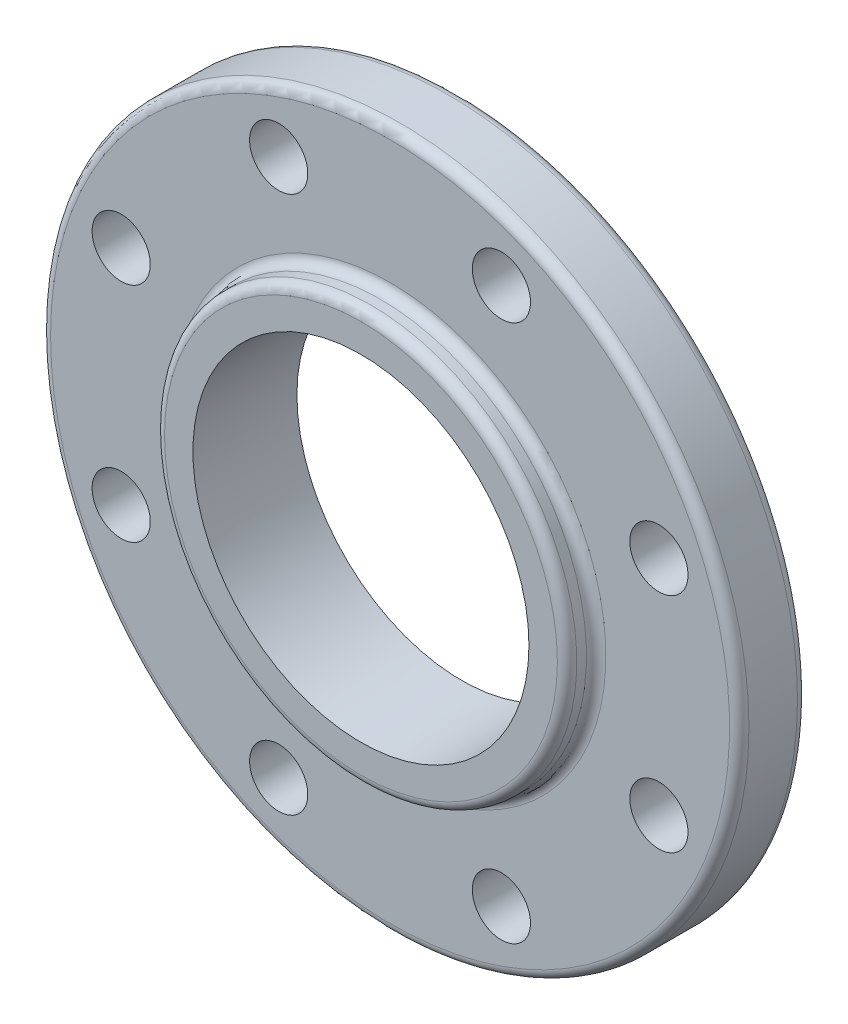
ISO-10303-21;
HEADER;
FILE_DESCRIPTION(('STEP AP214'),'2;1');
FILE_NAME('part.step','',(''),(''),'','','');
FILE_SCHEMA(('AUTOMOTIVE_DESIGN { 1 0 10303 214 1 1 1 1 }'));
ENDSEC;
DATA;
#1=APPLICATION_CONTEXT('core data for automotive mechanical design processes');
#2=APPLICATION_PROTOCOL_DEFINITION('international standard','automotive_design',2000,#1);
#3=PRODUCT_CONTEXT('',#1,'mechanical');
#4=PRODUCT('Part','Part','',(#3));
#5=PRODUCT_RELATED_PRODUCT_CATEGORY('part','',(#4));
#6=PRODUCT_DEFINITION_FORMATION('','',#4);
#7=PRODUCT_DEFINITION_CONTEXT('part definition',#1,'design');
#8=PRODUCT_DEFINITION('design','',#6,#7);
#9=PRODUCT_DEFINITION_SHAPE('','',#8);
#10=(LENGTH_UNIT() NAMED_UNIT(*) SI_UNIT(.MILLI.,.METRE.));
#11=(NAMED_UNIT(*) PLANE_ANGLE_UNIT() SI_UNIT($,.RADIAN.));
#12=(NAMED_UNIT(*) SI_UNIT($,.STERADIAN.) SOLID_ANGLE_UNIT());
#13=UNCERTAINTY_MEASURE_WITH_UNIT(LENGTH_MEASURE(1.E-05),#10,'distance_accuracy_value','');
#14=(GEOMETRIC_REPRESENTATION_CONTEXT(3) GLOBAL_UNCERTAINTY_ASSIGNED_CONTEXT((#13)) GLOBAL_UNIT_ASSIGNED_CONTEXT((#10,
#11,#12)) REPRESENTATION_CONTEXT('',''));
#15=CARTESIAN_POINT('',(0.,0.,0.));
#16=DIRECTION('',(0.,0.,1.));
#17=DIRECTION('',(1.,0.,0.));
#18=AXIS2_PLACEMENT_3D('',#15,#16,#17);
#19=CARTESIAN_POINT('',(0.,0.,33.3375));
#20=DIRECTION('',(0.,0.,-1.));
#21=DIRECTION('',(-1.00000000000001,0.,0.));
#22=AXIS2_PLACEMENT_3D('',#19,#20,#21);
#23=PLANE('',#22);
#24=CARTESIAN_POINT('',(0.,0.,33.3375));
#25=DIRECTION('',(0.,0.,-1.));
#26=DIRECTION('',(-1.00000000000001,0.,0.));
#27=AXIS2_PLACEMENT_3D('',#24,#25,#26);
#28=CIRCLE('',#27,64.29375);
#29=CARTESIAN_POINT('',(-64.2937500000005,0.,33.3375));
#30=VERTEX_POINT('',#29);
#31=EDGE_CURVE('E10',#30,#30,#28,.T.);
#32=ORIENTED_EDGE('',*,*,#31,.F.);
#33=EDGE_LOOP('',(#32));
#34=FACE_BOUND('',#33,.T.);
#35=CARTESIAN_POINT('',(0.,0.,33.3375));
#36=DIRECTION('',(0.,0.,1.));
#37=DIRECTION('',(1.00000000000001,0.,0.));
#38=AXIS2_PLACEMENT_3D('',#35,#36,#37);
#39=CIRCLE('',#38,54.991);
#40=CARTESIAN_POINT('',(54.9910000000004,0.,33.3375));
#41=VERTEX_POINT('',#40);
#42=EDGE_CURVE('E127',#41,#41,#39,.T.);
#43=ORIENTED_EDGE('',*,*,#42,.F.);
#44=EDGE_LOOP('',(#43));
#45=FACE_BOUND('',#44,.T.);
#46=ADVANCED_FACE('F30',(#34,#45),#23,.F.);
#47=CARTESIAN_POINT('',(0.,0.,30.1625));
#48=DIRECTION('',(0.,0.,-1.));
#49=DIRECTION('',(-1.00000000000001,0.,0.));
#50=AXIS2_PLACEMENT_3D('',#47,#48,#49);
#51=TOROIDAL_SURFACE('',#50,64.29375,3.175);
#52=CARTESIAN_POINT('',(0.,0.,30.1625));
#53=DIRECTION('',(0.,0.,-1.));
#54=DIRECTION('',(-1.00000000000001,0.,0.));
#55=AXIS2_PLACEMENT_3D('',#52,#53,#54);
#56=CIRCLE('',#55,67.46875);
#57=CARTESIAN_POINT('',(-67.4687500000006,0.,30.1625));
#58=VERTEX_POINT('',#57);
#59=EDGE_CURVE('E36',#58,#58,#56,.T.);
#60=ORIENTED_EDGE('',*,*,#59,.F.);
#61=EDGE_LOOP('',(#60));
#62=FACE_BOUND('',#61,.T.);
#63=ORIENTED_EDGE('',*,*,#31,.T.);
#64=EDGE_LOOP('',(#63));
#65=FACE_BOUND('',#64,.T.);
#66=ADVANCED_FACE('F134',(#62,#65),#51,.T.);
#67=CARTESIAN_POINT('',(0.,0.,-31.2122387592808));
#68=DIRECTION('',(0.,0.,-1.));
#69=DIRECTION('',(-1.00000000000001,0.,0.));
#70=AXIS2_PLACEMENT_3D('',#67,#68,#69);
#71=CYLINDRICAL_SURFACE('',#70,67.46875);
#72=CARTESIAN_POINT('',(0.,0.,26.9875));
#73=DIRECTION('',(0.,0.,-1.));
#74=DIRECTION('',(-1.00000000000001,0.,0.));
#75=AXIS2_PLACEMENT_3D('',#72,#73,#74);
#76=CIRCLE('',#75,67.46875);
#77=CARTESIAN_POINT('',(-67.4687500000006,0.,26.9875));
#78=VERTEX_POINT('',#77);
#79=EDGE_CURVE('E40',#78,#78,#76,.T.);
#80=ORIENTED_EDGE('',*,*,#79,.F.);
#81=EDGE_LOOP('',(#80));
#82=FACE_BOUND('',#81,.T.);
#83=ORIENTED_EDGE('',*,*,#59,.T.);
#84=EDGE_LOOP('',(#83));
#85=FACE_BOUND('',#84,.T.);
#86=ADVANCED_FACE('F139',(#82,#85),#71,.T.);
#87=CARTESIAN_POINT('',(0.,0.,26.9875));
#88=DIRECTION('',(0.,0.,-1.));
#89=DIRECTION('',(-1.00000000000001,0.,0.));
#90=AXIS2_PLACEMENT_3D('',#87,#88,#89);
#91=TOROIDAL_SURFACE('',#90,70.64375,3.17500000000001);
#92=CARTESIAN_POINT('',(0.,0.,23.8125));
#93=DIRECTION('',(0.,0.,-1.));
#94=DIRECTION('',(-1.00000000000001,0.,0.));
#95=AXIS2_PLACEMENT_3D('',#92,#93,#94);
#96=CIRCLE('',#95,70.64375);
#97=CARTESIAN_POINT('',(-70.6437500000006,0.,23.8125));
#98=VERTEX_POINT('',#97);
#99=EDGE_CURVE('E44',#98,#98,#96,.T.);
#100=ORIENTED_EDGE('',*,*,#99,.F.);
#101=EDGE_LOOP('',(#100));
#102=FACE_BOUND('',#101,.T.);
#103=ORIENTED_EDGE('',*,*,#79,.T.);
#104=EDGE_LOOP('',(#103));
#105=FACE_BOUND('',#104,.T.);
#106=ADVANCED_FACE('F144',(#102,#105),#91,.F.);
#107=CARTESIAN_POINT('',(111.125,0.,23.8125));
#108=DIRECTION('',(0.,0.,-1.));
#109=DIRECTION('',(-1.00000000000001,0.,0.));
#110=AXIS2_PLACEMENT_3D('',#107,#108,#109);
#111=PLANE('',#110);
#112=CARTESIAN_POINT('',(36.4505969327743,87.9995254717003,23.8125));
#113=DIRECTION('',(0.,0.,-1.));
#114=DIRECTION('',(-1.00000000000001,0.,0.));
#115=AXIS2_PLACEMENT_3D('',#112,#113,#114);
#116=CIRCLE('',#115,9.525);
#117=CARTESIAN_POINT('',(26.9255969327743,87.9995254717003,23.8125));
#118=VERTEX_POINT('',#117);
#119=EDGE_CURVE('E112',#118,#118,#116,.T.);
#120=ORIENTED_EDGE('',*,*,#119,.T.);
#121=EDGE_LOOP('',(#120));
#122=FACE_BOUND('',#121,.T.);
#123=CARTESIAN_POINT('',(87.9995254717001,36.4505969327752,23.8125));
#124=DIRECTION('',(0.,0.,-1.));
#125=DIRECTION('',(-1.00000000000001,0.,0.));
#126=AXIS2_PLACEMENT_3D('',#123,#124,#125);
#127=CIRCLE('',#126,9.525);
#128=CARTESIAN_POINT('',(78.4745254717,36.4505969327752,23.8125));
#129=VERTEX_POINT('',#128);
#130=EDGE_CURVE('E106',#129,#129,#127,.T.);
#131=ORIENTED_EDGE('',*,*,#130,.T.);
#132=EDGE_LOOP('',(#131));
#133=FACE_BOUND('',#132,.T.);
#134=CARTESIAN_POINT('',(87.9995254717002,-36.4505969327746,23.8125));
#135=DIRECTION('',(0.,0.,-1.));
#136=DIRECTION('',(-1.00000000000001,0.,0.));
#137=AXIS2_PLACEMENT_3D('',#134,#135,#136);
#138=CIRCLE('',#137,9.525);
#139=CARTESIAN_POINT('',(78.4745254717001,-36.4505969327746,23.8125));
#140=VERTEX_POINT('',#139);
#141=EDGE_CURVE('E100',#140,#140,#138,.T.);
#142=ORIENTED_EDGE('',*,*,#141,.T.);
#143=EDGE_LOOP('',(#142));
#144=FACE_BOUND('',#143,.T.);
#145=CARTESIAN_POINT('',(36.4505969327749,-87.9995254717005,23.8125));
#146=DIRECTION('',(0.,0.,-1.));
#147=DIRECTION('',(-1.00000000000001,0.,0.));
#148=AXIS2_PLACEMENT_3D('',#145,#146,#147);
#149=CIRCLE('',#148,9.525);
#150=CARTESIAN_POINT('',(26.9255969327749,-87.9995254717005,23.8125));
#151=VERTEX_POINT('',#150);
#152=EDGE_CURVE('E94',#151,#151,#149,.T.);
#153=ORIENTED_EDGE('',*,*,#152,.T.);
#154=EDGE_LOOP('',(#153));
#155=FACE_BOUND('',#154,.T.);
#156=CARTESIAN_POINT('',(-36.4505969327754,-87.9995254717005,23.8125));
#157=DIRECTION('',(0.,0.,-1.));
#158=DIRECTION('',(-1.00000000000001,0.,0.));
#159=AXIS2_PLACEMENT_3D('',#156,#157,#158);
#160=CIRCLE('',#159,9.525);
#161=CARTESIAN_POINT('',(-45.9755969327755,-87.9995254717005,23.8125));
#162=VERTEX_POINT('',#161);
#163=EDGE_CURVE('E88',#162,#162,#160,.T.);
#164=ORIENTED_EDGE('',*,*,#163,.T.);
#165=EDGE_LOOP('',(#164));
#166=FACE_BOUND('',#165,.T.);
#167=CARTESIAN_POINT('',(-87.999525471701,-36.4505969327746,23.8125));
#168=DIRECTION('',(0.,0.,-1.));
#169=DIRECTION('',(-1.00000000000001,0.,0.));
#170=AXIS2_PLACEMENT_3D('',#167,#168,#169);
#171=CIRCLE('',#170,9.525);
#172=CARTESIAN_POINT('',(-97.5245254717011,-36.4505969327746,23.8125));
#173=VERTEX_POINT('',#172);
#174=EDGE_CURVE('E82',#173,#173,#171,.T.);
#175=ORIENTED_EDGE('',*,*,#174,.T.);
#176=EDGE_LOOP('',(#175));
#177=FACE_BOUND('',#176,.T.);
#178=CARTESIAN_POINT('',(-87.9995254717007,36.4505969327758,23.8125));
#179=DIRECTION('',(0.,0.,-1.));
#180=DIRECTION('',(-1.00000000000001,0.,0.));
#181=AXIS2_PLACEMENT_3D('',#178,#179,#180);
#182=CIRCLE('',#181,9.525);
#183=CARTESIAN_POINT('',(-97.5245254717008,36.4505969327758,23.8125));
#184=VERTEX_POINT('',#183);
#185=EDGE_CURVE('E76',#184,#184,#182,.T.);
#186=ORIENTED_EDGE('',*,*,#185,.T.);
#187=EDGE_LOOP('',(#186));
#188=FACE_BOUND('',#187,.T.);
#189=CARTESIAN_POINT('',(-36.4505969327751,87.9995254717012,23.8125));
#190=DIRECTION('',(0.,0.,-1.));
#191=DIRECTION('',(-1.00000000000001,0.,0.));
#192=AXIS2_PLACEMENT_3D('',#189,#190,#191);
#193=CIRCLE('',#192,9.525);
#194=CARTESIAN_POINT('',(-45.9755969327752,87.9995254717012,23.8125));
#195=VERTEX_POINT('',#194);
#196=EDGE_CURVE('E70',#195,#195,#193,.T.);
#197=ORIENTED_EDGE('',*,*,#196,.T.);
#198=EDGE_LOOP('',(#197));
#199=FACE_BOUND('',#198,.T.);
#200=CARTESIAN_POINT('',(0.,0.,23.8125));
#201=DIRECTION('',(0.,0.,-1.));
#202=DIRECTION('',(-1.00000000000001,0.,0.));
#203=AXIS2_PLACEMENT_3D('',#200,#201,#202);
#204=CIRCLE('',#203,111.125);
#205=CARTESIAN_POINT('',(-111.125000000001,0.,23.8125));
#206=VERTEX_POINT('',#205);
#207=EDGE_CURVE('E49',#206,#206,#204,.T.);
#208=ORIENTED_EDGE('',*,*,#207,.F.);
#209=EDGE_LOOP('',(#208));
#210=FACE_BOUND('',#209,.T.);
#211=ORIENTED_EDGE('',*,*,#99,.T.);
#212=EDGE_LOOP('',(#211));
#213=FACE_BOUND('',#212,.T.);
#214=ADVANCED_FACE('F150',(#122,#133,#144,#155,#166,#177,#188,#199,#210,#213),#111,.F.);
#215=CARTESIAN_POINT('',(0.,0.,20.6375));
#216=DIRECTION('',(0.,0.,-1.));
#217=DIRECTION('',(-1.00000000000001,0.,0.));
#218=AXIS2_PLACEMENT_3D('',#215,#216,#217);
#219=TOROIDAL_SURFACE('',#218,111.125,3.175);
#220=CARTESIAN_POINT('',(0.,0.,20.6375));
#221=DIRECTION('',(0.,0.,-1.));
#222=DIRECTION('',(-1.00000000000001,0.,0.));
#223=AXIS2_PLACEMENT_3D('',#220,#221,#222);
#224=CIRCLE('',#223,114.3);
#225=CARTESIAN_POINT('',(-114.300000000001,0.,20.6375));
#226=VERTEX_POINT('',#225);
#227=EDGE_CURVE('E52',#226,#226,#224,.T.);
#228=ORIENTED_EDGE('',*,*,#227,.F.);
#229=EDGE_LOOP('',(#228));
#230=FACE_BOUND('',#229,.T.);
#231=ORIENTED_EDGE('',*,*,#207,.T.);
#232=EDGE_LOOP('',(#231));
#233=FACE_BOUND('',#232,.T.);
#234=ADVANCED_FACE('F154',(#230,#233),#219,.T.);
#235=CARTESIAN_POINT('',(0.,0.,-31.2122387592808));
#236=DIRECTION('',(0.,0.,-1.));
#237=DIRECTION('',(-1.00000000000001,0.,0.));
#238=AXIS2_PLACEMENT_3D('',#235,#236,#237);
#239=CYLINDRICAL_SURFACE('',#238,114.3);
#240=CARTESIAN_POINT('',(0.,0.,4.7625));
#241=DIRECTION('',(0.,0.,-1.));
#242=DIRECTION('',(-1.00000000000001,0.,0.));
#243=AXIS2_PLACEMENT_3D('',#240,#241,#242);
#244=CIRCLE('',#243,114.3);
#245=CARTESIAN_POINT('',(-114.300000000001,0.,4.7625));
#246=VERTEX_POINT('',#245);
#247=EDGE_CURVE('E55',#246,#246,#244,.T.);
#248=ORIENTED_EDGE('',*,*,#247,.F.);
#249=EDGE_LOOP('',(#248));
#250=FACE_BOUND('',#249,.T.);
#251=ORIENTED_EDGE('',*,*,#227,.T.);
#252=EDGE_LOOP('',(#251));
#253=FACE_BOUND('',#252,.T.);
#254=ADVANCED_FACE('F158',(#250,#253),#239,.T.);
#255=CARTESIAN_POINT('',(0.,0.,4.7625));
#256=DIRECTION('',(0.,0.,-1.));
#257=DIRECTION('',(-1.00000000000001,0.,0.));
#258=AXIS2_PLACEMENT_3D('',#255,#256,#257);
#259=TOROIDAL_SURFACE('',#258,111.125,3.175);
#260=CARTESIAN_POINT('',(0.,0.,1.58749999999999));
#261=DIRECTION('',(0.,0.,-1.));
#262=DIRECTION('',(-1.00000000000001,0.,0.));
#263=AXIS2_PLACEMENT_3D('',#260,#261,#262);
#264=CIRCLE('',#263,111.125);
#265=CARTESIAN_POINT('',(-111.125000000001,0.,1.58749999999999));
#266=VERTEX_POINT('',#265);
#267=EDGE_CURVE('E58',#266,#266,#264,.T.);
#268=ORIENTED_EDGE('',*,*,#267,.F.);
#269=EDGE_LOOP('',(#268));
#270=FACE_BOUND('',#269,.T.);
#271=ORIENTED_EDGE('',*,*,#247,.T.);
#272=EDGE_LOOP('',(#271));
#273=FACE_BOUND('',#272,.T.);
#274=ADVANCED_FACE('F162',(#270,#273),#259,.T.);
#275=CARTESIAN_POINT('',(80.1052500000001,0.,1.58749999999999));
#276=DIRECTION('',(0.,0.,1.));
#277=DIRECTION('',(1.00000000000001,0.,0.));
#278=AXIS2_PLACEMENT_3D('',#275,#276,#277);
#279=PLANE('',#278);
#280=CARTESIAN_POINT('',(36.4505969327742,87.9995254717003,1.58749999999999));
#281=DIRECTION('',(0.,0.,-1.));
#282=DIRECTION('',(-0.707106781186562,0.707106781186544,0.));
#283=AXIS2_PLACEMENT_3D('',#280,#281,#282);
#284=CIRCLE('',#283,9.525);
#285=CARTESIAN_POINT('',(29.7154048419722,94.7347175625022,1.58749999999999));
#286=VERTEX_POINT('',#285);
#287=EDGE_CURVE('E115',#286,#286,#284,.T.);
#288=ORIENTED_EDGE('',*,*,#287,.F.);
#289=EDGE_LOOP('',(#288));
#290=FACE_BOUND('',#289,.T.);
#291=CARTESIAN_POINT('',(87.9995254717,36.4505969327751,1.58749999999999));
#292=DIRECTION('',(0.,0.,-1.));
#293=DIRECTION('',(0.,1.00000000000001,0.));
#294=AXIS2_PLACEMENT_3D('',#291,#292,#293);
#295=CIRCLE('',#294,9.525);
#296=CARTESIAN_POINT('',(87.9995254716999,45.9755969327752,1.58749999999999));
#297=VERTEX_POINT('',#296);
#298=EDGE_CURVE('E109',#297,#297,#295,.T.);
#299=ORIENTED_EDGE('',*,*,#298,.F.);
#300=EDGE_LOOP('',(#299));
#301=FACE_BOUND('',#300,.T.);
#302=CARTESIAN_POINT('',(87.9995254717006,-36.450596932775,1.58749999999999));
#303=DIRECTION('',(0.,0.,-1.));
#304=DIRECTION('',(0.707106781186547,0.707106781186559,0.));
#305=AXIS2_PLACEMENT_3D('',#302,#303,#304);
#306=CIRCLE('',#305,9.525);
#307=CARTESIAN_POINT('',(94.7347175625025,-29.715404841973,1.58749999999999));
#308=VERTEX_POINT('',#307);
#309=EDGE_CURVE('E103',#308,#308,#306,.T.);
#310=ORIENTED_EDGE('',*,*,#309,.F.);
#311=EDGE_LOOP('',(#310));
#312=FACE_BOUND('',#311,.T.);
#313=CARTESIAN_POINT('',(36.4505969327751,-87.9995254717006,1.58749999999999));
#314=DIRECTION('',(0.,0.,-1.));
#315=DIRECTION('',(1.00000000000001,0.,0.));
#316=AXIS2_PLACEMENT_3D('',#313,#314,#315);
#317=CIRCLE('',#316,9.525);
#318=CARTESIAN_POINT('',(45.9755969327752,-87.9995254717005,1.58749999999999));
#319=VERTEX_POINT('',#318);
#320=EDGE_CURVE('E97',#319,#319,#317,.T.);
#321=ORIENTED_EDGE('',*,*,#320,.F.);
#322=EDGE_LOOP('',(#321));
#323=FACE_BOUND('',#322,.T.);
#324=CARTESIAN_POINT('',(-36.4505969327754,-87.9995254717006,1.58749999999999));
#325=DIRECTION('',(0.,0.,-1.));
#326=DIRECTION('',(0.707106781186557,-0.70710678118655,0.));
#327=AXIS2_PLACEMENT_3D('',#324,#325,#326);
#328=CIRCLE('',#327,9.525);
#329=CARTESIAN_POINT('',(-29.7154048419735,-94.7347175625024,1.58749999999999));
#330=VERTEX_POINT('',#329);
#331=EDGE_CURVE('E91',#330,#330,#328,.T.);
#332=ORIENTED_EDGE('',*,*,#331,.F.);
#333=EDGE_LOOP('',(#332));
#334=FACE_BOUND('',#333,.T.);
#335=CARTESIAN_POINT('',(-87.9995254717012,-36.4505969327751,1.58749999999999));
#336=DIRECTION('',(0.,0.,-1.));
#337=DIRECTION('',(0.,-1.00000000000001,0.));
#338=AXIS2_PLACEMENT_3D('',#335,#336,#337);
#339=CIRCLE('',#338,9.525);
#340=CARTESIAN_POINT('',(-87.9995254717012,-45.9755969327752,1.58749999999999));
#341=VERTEX_POINT('',#340);
#342=EDGE_CURVE('E85',#341,#341,#339,.T.);
#343=ORIENTED_EDGE('',*,*,#342,.F.);
#344=EDGE_LOOP('',(#343));
#345=FACE_BOUND('',#344,.T.);
#346=CARTESIAN_POINT('',(-87.9995254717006,36.4505969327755,1.58749999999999));
#347=DIRECTION('',(0.,0.,-1.));
#348=DIRECTION('',(-0.707106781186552,-0.707106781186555,0.));
#349=AXIS2_PLACEMENT_3D('',#346,#347,#348);
#350=CIRCLE('',#349,9.525);
#351=CARTESIAN_POINT('',(-94.7347175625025,29.7154048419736,1.58749999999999));
#352=VERTEX_POINT('',#351);
#353=EDGE_CURVE('E79',#352,#352,#350,.T.);
#354=ORIENTED_EDGE('',*,*,#353,.F.);
#355=EDGE_LOOP('',(#354));
#356=FACE_BOUND('',#355,.T.);
#357=CARTESIAN_POINT('',(-36.4505969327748,87.9995254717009,1.58749999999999));
#358=DIRECTION('',(0.,0.,-1.));
#359=DIRECTION('',(-1.00000000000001,0.,0.));
#360=AXIS2_PLACEMENT_3D('',#357,#358,#359);
#361=CIRCLE('',#360,9.525);
#362=CARTESIAN_POINT('',(-45.9755969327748,87.9995254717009,1.58749999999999));
#363=VERTEX_POINT('',#362);
#364=EDGE_CURVE('E73',#363,#363,#361,.T.);
#365=ORIENTED_EDGE('',*,*,#364,.F.);
#366=EDGE_LOOP('',(#365));
#367=FACE_BOUND('',#366,.T.);
#368=CARTESIAN_POINT('',(0.,0.,1.58749999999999));
#369=DIRECTION('',(0.,0.,-1.));
#370=DIRECTION('',(-1.00000000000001,0.,0.));
#371=AXIS2_PLACEMENT_3D('',#368,#369,#370);
#372=CIRCLE('',#371,80.10525);
#373=CARTESIAN_POINT('',(-80.1052500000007,0.,1.58749999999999));
#374=VERTEX_POINT('',#373);
#375=EDGE_CURVE('E61',#374,#374,#372,.T.);
#376=ORIENTED_EDGE('',*,*,#375,.F.);
#377=EDGE_LOOP('',(#376));
#378=FACE_BOUND('',#377,.T.);
#379=ORIENTED_EDGE('',*,*,#267,.T.);
#380=EDGE_LOOP('',(#379));
#381=FACE_BOUND('',#380,.T.);
#382=ADVANCED_FACE('F166',(#290,#301,#312,#323,#334,#345,#356,#367,#378,#381),#279,.F.);
#383=CARTESIAN_POINT('',(0.,0.,0.0634999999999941));
#384=DIRECTION('',(0.,0.,-1.));
#385=DIRECTION('',(-1.00000000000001,0.,0.));
#386=AXIS2_PLACEMENT_3D('',#383,#384,#385);
#387=TOROIDAL_SURFACE('',#386,80.10525,1.524);
#388=CARTESIAN_POINT('',(0.,0.,0.0634999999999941));
#389=DIRECTION('',(0.,0.,-1.));
#390=DIRECTION('',(-1.00000000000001,0.,0.));
#391=AXIS2_PLACEMENT_3D('',#388,#389,#390);
#392=CIRCLE('',#391,78.58125);
#393=CARTESIAN_POINT('',(-78.5812500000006,0.,0.0634999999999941));
#394=VERTEX_POINT('',#393);
#395=EDGE_CURVE('E64',#394,#394,#392,.T.);
#396=ORIENTED_EDGE('',*,*,#395,.F.);
#397=EDGE_LOOP('',(#396));
#398=FACE_BOUND('',#397,.T.);
#399=ORIENTED_EDGE('',*,*,#375,.T.);
#400=EDGE_LOOP('',(#399));
#401=FACE_BOUND('',#400,.T.);
#402=ADVANCED_FACE('F170',(#398,#401),#387,.F.);
#403=CARTESIAN_POINT('',(0.,0.,-31.2122387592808));
#404=DIRECTION('',(0.,0.,-1.));
#405=DIRECTION('',(-1.00000000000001,0.,0.));
#406=AXIS2_PLACEMENT_3D('',#403,#404,#405);
#407=CYLINDRICAL_SURFACE('',#406,78.58125);
#408=CARTESIAN_POINT('',(0.,0.,0.));
#409=DIRECTION('',(0.,0.,-1.));
#410=DIRECTION('',(-1.00000000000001,0.,0.));
#411=AXIS2_PLACEMENT_3D('',#408,#409,#410);
#412=CIRCLE('',#411,78.58125);
#413=CARTESIAN_POINT('',(-78.5812500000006,0.,0.));
#414=VERTEX_POINT('',#413);
#415=EDGE_CURVE('E67',#414,#414,#412,.T.);
#416=ORIENTED_EDGE('',*,*,#415,.F.);
#417=EDGE_LOOP('',(#416));
#418=FACE_BOUND('',#417,.T.);
#419=ORIENTED_EDGE('',*,*,#395,.T.);
#420=EDGE_LOOP('',(#419));
#421=FACE_BOUND('',#420,.T.);
#422=ADVANCED_FACE('F174',(#418,#421),#407,.T.);
#423=CARTESIAN_POINT('',(0.,0.,0.));
#424=DIRECTION('',(0.,0.,1.));
#425=DIRECTION('',(1.00000000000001,0.,0.));
#426=AXIS2_PLACEMENT_3D('',#423,#424,#425);
#427=PLANE('',#426);
#428=CARTESIAN_POINT('',(0.,0.,0.));
#429=DIRECTION('',(0.,0.,1.));
#430=DIRECTION('',(1.00000000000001,0.,0.));
#431=AXIS2_PLACEMENT_3D('',#428,#429,#430);
#432=CIRCLE('',#431,55.5625);
#433=CARTESIAN_POINT('',(55.5625000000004,0.,0.));
#434=VERTEX_POINT('',#433);
#435=EDGE_CURVE('E118',#434,#434,#432,.T.);
#436=ORIENTED_EDGE('',*,*,#435,.T.);
#437=EDGE_LOOP('',(#436));
#438=FACE_BOUND('',#437,.T.);
#439=ORIENTED_EDGE('',*,*,#415,.T.);
#440=EDGE_LOOP('',(#439));
#441=FACE_BOUND('',#440,.T.);
#442=ADVANCED_FACE('F178',(#438,#441),#427,.F.);
#443=CARTESIAN_POINT('',(-36.4505969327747,87.9995254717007,33.3375));
#444=DIRECTION('',(0.,0.,-1.));
#445=DIRECTION('',(-1.00000000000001,0.,0.));
#446=AXIS2_PLACEMENT_3D('',#443,#444,#445);
#447=CYLINDRICAL_SURFACE('',#446,9.525);
#448=ORIENTED_EDGE('',*,*,#364,.T.);
#449=EDGE_LOOP('',(#448));
#450=FACE_BOUND('',#449,.T.);
#451=ORIENTED_EDGE('',*,*,#196,.F.);
#452=EDGE_LOOP('',(#451));
#453=FACE_BOUND('',#452,.T.);
#454=ADVANCED_FACE('F182',(#450,#453),#447,.F.);
#455=CARTESIAN_POINT('',(-87.9995254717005,36.4505969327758,33.3375));
#456=DIRECTION('',(0.,0.,-1.));
#457=DIRECTION('',(-1.00000000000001,0.,0.));
#458=AXIS2_PLACEMENT_3D('',#455,#456,#457);
#459=CYLINDRICAL_SURFACE('',#458,9.525);
#460=ORIENTED_EDGE('',*,*,#353,.T.);
#461=EDGE_LOOP('',(#460));
#462=FACE_BOUND('',#461,.T.);
#463=ORIENTED_EDGE('',*,*,#185,.F.);
#464=EDGE_LOOP('',(#463));
#465=FACE_BOUND('',#464,.T.);
#466=ADVANCED_FACE('F186',(#462,#465),#459,.F.);
#467=CARTESIAN_POINT('',(-87.9995254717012,-36.4505969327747,33.3375));
#468=DIRECTION('',(0.,0.,-1.));
#469=DIRECTION('',(-1.00000000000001,0.,0.));
#470=AXIS2_PLACEMENT_3D('',#467,#468,#469);
#471=CYLINDRICAL_SURFACE('',#470,9.525);
#472=ORIENTED_EDGE('',*,*,#342,.T.);
#473=EDGE_LOOP('',(#472));
#474=FACE_BOUND('',#473,.T.);
#475=ORIENTED_EDGE('',*,*,#174,.F.);
#476=EDGE_LOOP('',(#475));
#477=FACE_BOUND('',#476,.T.);
#478=ADVANCED_FACE('F190',(#474,#477),#471,.F.);
#479=CARTESIAN_POINT('',(-36.4505969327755,-87.9995254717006,33.3375));
#480=DIRECTION('',(0.,0.,-1.));
#481=DIRECTION('',(-1.00000000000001,0.,0.));
#482=AXIS2_PLACEMENT_3D('',#479,#480,#481);
#483=CYLINDRICAL_SURFACE('',#482,9.525);
#484=ORIENTED_EDGE('',*,*,#331,.T.);
#485=EDGE_LOOP('',(#484));
#486=FACE_BOUND('',#485,.T.);
#487=ORIENTED_EDGE('',*,*,#163,.F.);
#488=EDGE_LOOP('',(#487));
#489=FACE_BOUND('',#488,.T.);
#490=ADVANCED_FACE('F194',(#486,#489),#483,.F.);
#491=CARTESIAN_POINT('',(36.4505969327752,-87.9995254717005,33.3375));
#492=DIRECTION('',(0.,0.,-1.));
#493=DIRECTION('',(-1.00000000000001,0.,0.));
#494=AXIS2_PLACEMENT_3D('',#491,#492,#493);
#495=CYLINDRICAL_SURFACE('',#494,9.525);
#496=ORIENTED_EDGE('',*,*,#320,.T.);
#497=EDGE_LOOP('',(#496));
#498=FACE_BOUND('',#497,.T.);
#499=ORIENTED_EDGE('',*,*,#152,.F.);
#500=EDGE_LOOP('',(#499));
#501=FACE_BOUND('',#500,.T.);
#502=ADVANCED_FACE('F198',(#498,#501),#495,.F.);
#503=CARTESIAN_POINT('',(87.9995254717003,-36.4505969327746,33.3375));
#504=DIRECTION('',(0.,0.,-1.));
#505=DIRECTION('',(-1.00000000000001,0.,0.));
#506=AXIS2_PLACEMENT_3D('',#503,#504,#505);
#507=CYLINDRICAL_SURFACE('',#506,9.525);
#508=ORIENTED_EDGE('',*,*,#309,.T.);
#509=EDGE_LOOP('',(#508));
#510=FACE_BOUND('',#509,.T.);
#511=ORIENTED_EDGE('',*,*,#141,.F.);
#512=EDGE_LOOP('',(#511));
#513=FACE_BOUND('',#512,.T.);
#514=ADVANCED_FACE('F202',(#510,#513),#507,.F.);
#515=CARTESIAN_POINT('',(87.9995254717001,36.4505969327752,33.3375));
#516=DIRECTION('',(0.,0.,-1.));
#517=DIRECTION('',(-1.00000000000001,0.,0.));
#518=AXIS2_PLACEMENT_3D('',#515,#516,#517);
#519=CYLINDRICAL_SURFACE('',#518,9.525);
#520=ORIENTED_EDGE('',*,*,#298,.T.);
#521=EDGE_LOOP('',(#520));
#522=FACE_BOUND('',#521,.T.);
#523=ORIENTED_EDGE('',*,*,#130,.F.);
#524=EDGE_LOOP('',(#523));
#525=FACE_BOUND('',#524,.T.);
#526=ADVANCED_FACE('F206',(#522,#525),#519,.F.);
#527=CARTESIAN_POINT('',(36.4505969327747,87.9995254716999,33.3375));
#528=DIRECTION('',(0.,0.,-1.));
#529=DIRECTION('',(-1.00000000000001,0.,0.));
#530=AXIS2_PLACEMENT_3D('',#527,#528,#529);
#531=CYLINDRICAL_SURFACE('',#530,9.525);
#532=ORIENTED_EDGE('',*,*,#287,.T.);
#533=EDGE_LOOP('',(#532));
#534=FACE_BOUND('',#533,.T.);
#535=ORIENTED_EDGE('',*,*,#119,.F.);
#536=EDGE_LOOP('',(#535));
#537=FACE_BOUND('',#536,.T.);
#538=ADVANCED_FACE('F210',(#534,#537),#531,.F.);
#539=CARTESIAN_POINT('',(0.,0.,33.3375));
#540=DIRECTION('',(0.,0.,1.));
#541=DIRECTION('',(1.00000000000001,0.,0.));
#542=AXIS2_PLACEMENT_3D('',#539,#540,#541);
#543=CYLINDRICAL_SURFACE('',#542,55.5625);
#544=ORIENTED_EDGE('',*,*,#435,.F.);
#545=EDGE_LOOP('',(#544));
#546=FACE_BOUND('',#545,.T.);
#547=CARTESIAN_POINT('',(0.,0.,0.317499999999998));
#548=DIRECTION('',(0.,0.,1.));
#549=DIRECTION('',(1.00000000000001,0.,0.));
#550=AXIS2_PLACEMENT_3D('',#547,#548,#549);
#551=CIRCLE('',#550,55.5625);
#552=CARTESIAN_POINT('',(55.5625000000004,0.,0.317499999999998));
#553=VERTEX_POINT('',#552);
#554=EDGE_CURVE('E121',#553,#553,#551,.T.);
#555=ORIENTED_EDGE('',*,*,#554,.T.);
#556=EDGE_LOOP('',(#555));
#557=FACE_BOUND('',#556,.T.);
#558=ADVANCED_FACE('F214',(#546,#557),#543,.F.);
#559=CARTESIAN_POINT('',(55.5625,-1.11022302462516E-13,0.317499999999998));
#560=DIRECTION('',(0.,0.,1.));
#561=DIRECTION('',(1.00000000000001,0.,0.));
#562=AXIS2_PLACEMENT_3D('',#559,#560,#561);
#563=PLANE('',#562);
#564=ORIENTED_EDGE('',*,*,#554,.F.);
#565=EDGE_LOOP('',(#564));
#566=FACE_BOUND('',#565,.T.);
#567=CARTESIAN_POINT('',(0.,0.,0.317499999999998));
#568=DIRECTION('',(0.,0.,1.));
#569=DIRECTION('',(1.00000000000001,0.,0.));
#570=AXIS2_PLACEMENT_3D('',#567,#568,#569);
#571=CIRCLE('',#570,53.9821477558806);
#572=CARTESIAN_POINT('',(53.982147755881,0.,0.317499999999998));
#573=VERTEX_POINT('',#572);
#574=EDGE_CURVE('E124',#573,#573,#571,.T.);
#575=ORIENTED_EDGE('',*,*,#574,.T.);
#576=EDGE_LOOP('',(#575));
#577=FACE_BOUND('',#576,.T.);
#578=ADVANCED_FACE('F218',(#566,#577),#563,.F.);
#579=CARTESIAN_POINT('',(0.,0.,33.3375));
#580=DIRECTION('',(0.,0.,1.));
#581=DIRECTION('',(1.00000000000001,0.,0.));
#582=AXIS2_PLACEMENT_3D('',#579,#580,#581);
#583=CONICAL_SURFACE('',#582,54.991,0.0305432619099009);
#584=ORIENTED_EDGE('',*,*,#574,.F.);
#585=EDGE_LOOP('',(#584));
#586=FACE_BOUND('',#585,.T.);
#587=ORIENTED_EDGE('',*,*,#42,.T.);
#588=EDGE_LOOP('',(#587));
#589=FACE_BOUND('',#588,.T.);
#590=ADVANCED_FACE('F131',(#586,#589),#583,.F.);
#591=CLOSED_SHELL('',(#46,#66,#86,#106,#214,#234,#254,#274,#382,#402,#422,#442,#454,#466,#478,
#490,#502,#514,#526,#538,#558,#578,#590));
#592=MANIFOLD_SOLID_BREP('B2',#591);
#593=ADVANCED_BREP_SHAPE_REPRESENTATION('',(#18,#592),#14);
#594=SHAPE_DEFINITION_REPRESENTATION(#9,#593);
ENDSEC;
END-ISO-10303-21;
